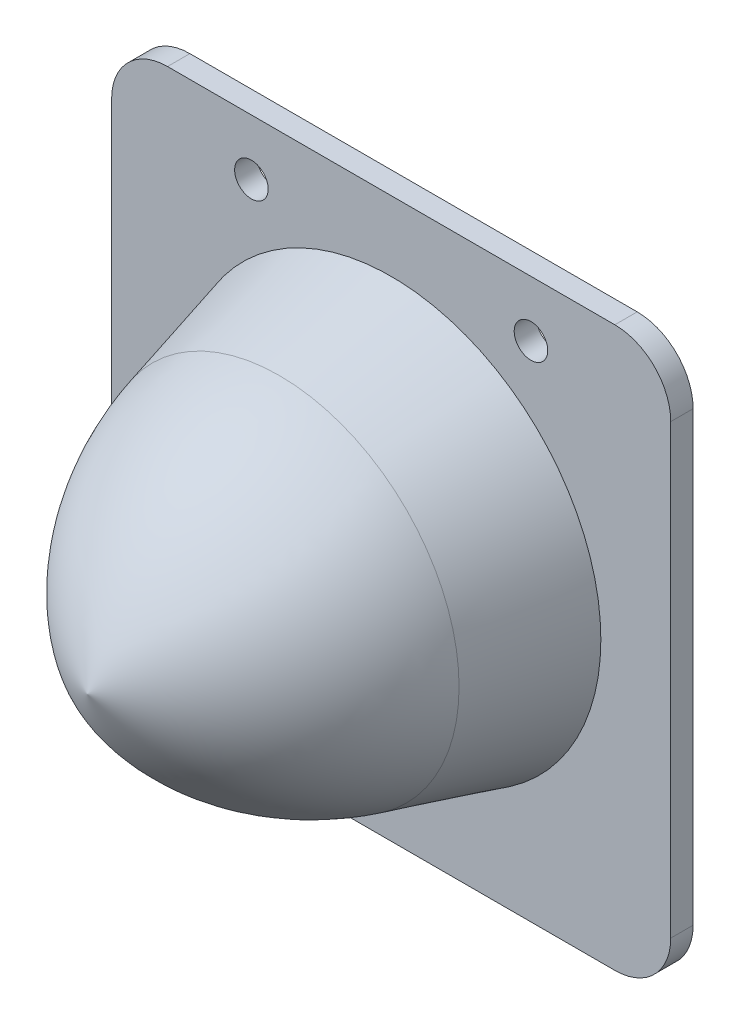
ISO-10303-21;
HEADER;
FILE_DESCRIPTION(('STEP AP214'),'2;1');
FILE_NAME('part.step','',(''),(''),'','','');
FILE_SCHEMA(('AUTOMOTIVE_DESIGN { 1 0 10303 214 1 1 1 1 }'));
ENDSEC;
DATA;
#1=APPLICATION_CONTEXT('core data for automotive mechanical design processes');
#2=APPLICATION_PROTOCOL_DEFINITION('international standard','automotive_design',2000,#1);
#3=PRODUCT_CONTEXT('',#1,'mechanical');
#4=PRODUCT('Part','Part','',(#3));
#5=PRODUCT_RELATED_PRODUCT_CATEGORY('part','',(#4));
#6=PRODUCT_DEFINITION_FORMATION('','',#4);
#7=PRODUCT_DEFINITION_CONTEXT('part definition',#1,'design');
#8=PRODUCT_DEFINITION('design','',#6,#7);
#9=PRODUCT_DEFINITION_SHAPE('','',#8);
#10=(LENGTH_UNIT() NAMED_UNIT(*) SI_UNIT(.MILLI.,.METRE.));
#11=(NAMED_UNIT(*) PLANE_ANGLE_UNIT() SI_UNIT($,.RADIAN.));
#12=(NAMED_UNIT(*) SI_UNIT($,.STERADIAN.) SOLID_ANGLE_UNIT());
#13=UNCERTAINTY_MEASURE_WITH_UNIT(LENGTH_MEASURE(1.E-05),#10,'distance_accuracy_value','');
#14=(GEOMETRIC_REPRESENTATION_CONTEXT(3) GLOBAL_UNCERTAINTY_ASSIGNED_CONTEXT((#13)) GLOBAL_UNIT_ASSIGNED_CONTEXT((#10,
#11,#12)) REPRESENTATION_CONTEXT('',''));
#15=CARTESIAN_POINT('',(0.,0.,0.));
#16=DIRECTION('',(0.,0.,1.));
#17=DIRECTION('',(1.,0.,0.));
#18=AXIS2_PLACEMENT_3D('',#15,#16,#17);
#19=CARTESIAN_POINT('',(50.,50.,4.));
#20=DIRECTION('',(-1.,0.,0.));
#21=DIRECTION('',(0.,0.,1.));
#22=AXIS2_PLACEMENT_3D('',#19,#20,#21);
#23=PLANE('',#22);
#24=DIRECTION('',(0.,1.,0.));
#25=VECTOR('',#24,1.);
#26=CARTESIAN_POINT('',(50.,50.,0.));
#27=LINE('',#26,#25);
#28=CARTESIAN_POINT('',(50.,-40.,0.));
#29=VERTEX_POINT('',#28);
#30=CARTESIAN_POINT('',(50.,40.,0.));
#31=VERTEX_POINT('',#30);
#32=EDGE_CURVE('E139',#29,#31,#27,.T.);
#33=ORIENTED_EDGE('',*,*,#32,.T.);
#34=DIRECTION('',(0.,0.,-1.));
#35=VECTOR('',#34,1.);
#36=CARTESIAN_POINT('',(50.,40.,4.));
#37=LINE('',#36,#35);
#38=CARTESIAN_POINT('',(50.,40.,4.));
#39=VERTEX_POINT('',#38);
#40=EDGE_CURVE('E176',#31,#39,#37,.F.);
#41=ORIENTED_EDGE('',*,*,#40,.T.);
#42=DIRECTION('',(0.,1.,0.));
#43=VECTOR('',#42,1.);
#44=CARTESIAN_POINT('',(50.,50.,4.));
#45=LINE('',#44,#43);
#46=CARTESIAN_POINT('',(50.,-40.,4.));
#47=VERTEX_POINT('',#46);
#48=EDGE_CURVE('E127',#47,#39,#45,.T.);
#49=ORIENTED_EDGE('',*,*,#48,.F.);
#50=DIRECTION('',(0.,0.,-1.));
#51=VECTOR('',#50,1.);
#52=CARTESIAN_POINT('',(50.,-40.,4.));
#53=LINE('',#52,#51);
#54=EDGE_CURVE('E173',#47,#29,#53,.T.);
#55=ORIENTED_EDGE('',*,*,#54,.T.);
#56=EDGE_LOOP('',(#33,#41,#49,#55));
#57=FACE_BOUND('',#56,.T.);
#58=ADVANCED_FACE('F34',(#57),#23,.F.);
#59=CARTESIAN_POINT('',(-50.,50.,4.));
#60=DIRECTION('',(0.,-1.,0.));
#61=DIRECTION('',(0.,0.,-1.));
#62=AXIS2_PLACEMENT_3D('',#59,#60,#61);
#63=PLANE('',#62);
#64=DIRECTION('',(-1.,0.,0.));
#65=VECTOR('',#64,1.);
#66=CARTESIAN_POINT('',(-50.,50.,0.));
#67=LINE('',#66,#65);
#68=CARTESIAN_POINT('',(40.,50.,0.));
#69=VERTEX_POINT('',#68);
#70=CARTESIAN_POINT('',(-40.,50.,0.));
#71=VERTEX_POINT('',#70);
#72=EDGE_CURVE('E142',#69,#71,#67,.T.);
#73=ORIENTED_EDGE('',*,*,#72,.T.);
#74=DIRECTION('',(0.,0.,-1.));
#75=VECTOR('',#74,1.);
#76=CARTESIAN_POINT('',(-40.,50.,4.));
#77=LINE('',#76,#75);
#78=CARTESIAN_POINT('',(-40.,50.,4.));
#79=VERTEX_POINT('',#78);
#80=EDGE_CURVE('E164',#71,#79,#77,.F.);
#81=ORIENTED_EDGE('',*,*,#80,.T.);
#82=DIRECTION('',(-1.,0.,0.));
#83=VECTOR('',#82,1.);
#84=CARTESIAN_POINT('',(-50.,50.,4.));
#85=LINE('',#84,#83);
#86=CARTESIAN_POINT('',(40.,50.,4.));
#87=VERTEX_POINT('',#86);
#88=EDGE_CURVE('E130',#87,#79,#85,.T.);
#89=ORIENTED_EDGE('',*,*,#88,.F.);
#90=DIRECTION('',(0.,0.,-1.));
#91=VECTOR('',#90,1.);
#92=CARTESIAN_POINT('',(40.,50.,4.));
#93=LINE('',#92,#91);
#94=EDGE_CURVE('E161',#87,#69,#93,.T.);
#95=ORIENTED_EDGE('',*,*,#94,.T.);
#96=EDGE_LOOP('',(#73,#81,#89,#95));
#97=FACE_BOUND('',#96,.T.);
#98=ADVANCED_FACE('F202',(#97),#63,.F.);
#99=CARTESIAN_POINT('',(-50.,50.,4.));
#100=DIRECTION('',(1.,0.,0.));
#101=DIRECTION('',(0.,1.,0.));
#102=AXIS2_PLACEMENT_3D('',#99,#100,#101);
#103=PLANE('',#102);
#104=DIRECTION('',(0.,-1.,0.));
#105=VECTOR('',#104,1.);
#106=CARTESIAN_POINT('',(-50.,50.,4.));
#107=LINE('',#106,#105);
#108=CARTESIAN_POINT('',(-50.,40.,4.));
#109=VERTEX_POINT('',#108);
#110=CARTESIAN_POINT('',(-50.,-40.,4.));
#111=VERTEX_POINT('',#110);
#112=EDGE_CURVE('E134',#109,#111,#107,.T.);
#113=ORIENTED_EDGE('',*,*,#112,.F.);
#114=DIRECTION('',(0.,0.,-1.));
#115=VECTOR('',#114,1.);
#116=CARTESIAN_POINT('',(-50.,40.,4.));
#117=LINE('',#116,#115);
#118=CARTESIAN_POINT('',(-50.,40.,0.));
#119=VERTEX_POINT('',#118);
#120=EDGE_CURVE('E150',#109,#119,#117,.T.);
#121=ORIENTED_EDGE('',*,*,#120,.T.);
#122=DIRECTION('',(0.,-1.,0.));
#123=VECTOR('',#122,1.);
#124=CARTESIAN_POINT('',(-50.,50.,0.));
#125=LINE('',#124,#123);
#126=CARTESIAN_POINT('',(-50.,-40.,0.));
#127=VERTEX_POINT('',#126);
#128=EDGE_CURVE('E145',#119,#127,#125,.T.);
#129=ORIENTED_EDGE('',*,*,#128,.T.);
#130=DIRECTION('',(0.,0.,-1.));
#131=VECTOR('',#130,1.);
#132=CARTESIAN_POINT('',(-50.,-40.,4.));
#133=LINE('',#132,#131);
#134=EDGE_CURVE('E138',#127,#111,#133,.F.);
#135=ORIENTED_EDGE('',*,*,#134,.T.);
#136=EDGE_LOOP('',(#113,#121,#129,#135));
#137=FACE_BOUND('',#136,.T.);
#138=ADVANCED_FACE('F208',(#137),#103,.F.);
#139=CARTESIAN_POINT('',(-50.,-50.,4.));
#140=DIRECTION('',(0.,1.,0.));
#141=DIRECTION('',(0.,0.,1.));
#142=AXIS2_PLACEMENT_3D('',#139,#140,#141);
#143=PLANE('',#142);
#144=DIRECTION('',(1.,0.,0.));
#145=VECTOR('',#144,1.);
#146=CARTESIAN_POINT('',(-50.,-50.,0.));
#147=LINE('',#146,#145);
#148=CARTESIAN_POINT('',(-40.,-50.,0.));
#149=VERTEX_POINT('',#148);
#150=CARTESIAN_POINT('',(40.,-50.,0.));
#151=VERTEX_POINT('',#150);
#152=EDGE_CURVE('E131',#149,#151,#147,.T.);
#153=ORIENTED_EDGE('',*,*,#152,.T.);
#154=DIRECTION('',(0.,0.,-1.));
#155=VECTOR('',#154,1.);
#156=CARTESIAN_POINT('',(40.,-50.,4.));
#157=LINE('',#156,#155);
#158=CARTESIAN_POINT('',(40.,-50.,4.));
#159=VERTEX_POINT('',#158);
#160=EDGE_CURVE('E43',#151,#159,#157,.F.);
#161=ORIENTED_EDGE('',*,*,#160,.T.);
#162=DIRECTION('',(1.,0.,0.));
#163=VECTOR('',#162,1.);
#164=CARTESIAN_POINT('',(-50.,-50.,4.));
#165=LINE('',#164,#163);
#166=CARTESIAN_POINT('',(-40.,-50.,4.));
#167=VERTEX_POINT('',#166);
#168=EDGE_CURVE('E136',#167,#159,#165,.T.);
#169=ORIENTED_EDGE('',*,*,#168,.F.);
#170=DIRECTION('',(0.,0.,-1.));
#171=VECTOR('',#170,1.);
#172=CARTESIAN_POINT('',(-40.,-50.,4.));
#173=LINE('',#172,#171);
#174=EDGE_CURVE('E178',#167,#149,#173,.T.);
#175=ORIENTED_EDGE('',*,*,#174,.T.);
#176=EDGE_LOOP('',(#153,#161,#169,#175));
#177=FACE_BOUND('',#176,.T.);
#178=ADVANCED_FACE('F246',(#177),#143,.F.);
#179=CARTESIAN_POINT('',(0.,0.,4.));
#180=DIRECTION('',(0.,0.,1.));
#181=DIRECTION('',(1.,0.,0.));
#182=AXIS2_PLACEMENT_3D('',#179,#180,#181);
#183=PLANE('',#182);
#184=CARTESIAN_POINT('',(0.,0.,4.));
#185=DIRECTION('',(0.,0.,1.));
#186=DIRECTION('',(1.,0.,0.));
#187=AXIS2_PLACEMENT_3D('',#184,#185,#186);
#188=CIRCLE('',#187,37.5);
#189=CARTESIAN_POINT('',(37.5,0.,4.));
#190=VERTEX_POINT('',#189);
#191=EDGE_CURVE('E11',#190,#190,#188,.T.);
#192=ORIENTED_EDGE('',*,*,#191,.F.);
#193=EDGE_LOOP('',(#192));
#194=FACE_BOUND('',#193,.T.);
#195=CARTESIAN_POINT('',(25.,40.,4.));
#196=DIRECTION('',(0.,0.,1.));
#197=DIRECTION('',(1.,0.,0.));
#198=AXIS2_PLACEMENT_3D('',#195,#196,#197);
#199=CIRCLE('',#198,3.);
#200=CARTESIAN_POINT('',(28.,40.,4.));
#201=VERTEX_POINT('',#200);
#202=EDGE_CURVE('E117',#201,#201,#199,.T.);
#203=ORIENTED_EDGE('',*,*,#202,.F.);
#204=EDGE_LOOP('',(#203));
#205=FACE_BOUND('',#204,.T.);
#206=CARTESIAN_POINT('',(-25.,40.,4.));
#207=DIRECTION('',(0.,0.,1.));
#208=DIRECTION('',(1.,0.,0.));
#209=AXIS2_PLACEMENT_3D('',#206,#207,#208);
#210=CIRCLE('',#209,3.);
#211=CARTESIAN_POINT('',(-22.,40.,4.));
#212=VERTEX_POINT('',#211);
#213=EDGE_CURVE('E113',#212,#212,#210,.T.);
#214=ORIENTED_EDGE('',*,*,#213,.F.);
#215=EDGE_LOOP('',(#214));
#216=FACE_BOUND('',#215,.T.);
#217=ORIENTED_EDGE('',*,*,#88,.T.);
#218=CARTESIAN_POINT('',(-40.,40.,4.));
#219=DIRECTION('',(0.,0.,1.));
#220=DIRECTION('',(1.,0.,0.));
#221=AXIS2_PLACEMENT_3D('',#218,#219,#220);
#222=CIRCLE('',#221,10.);
#223=EDGE_CURVE('E171',#79,#109,#222,.T.);
#224=ORIENTED_EDGE('',*,*,#223,.T.);
#225=ORIENTED_EDGE('',*,*,#112,.T.);
#226=CARTESIAN_POINT('',(-40.,-40.,4.));
#227=DIRECTION('',(0.,0.,1.));
#228=DIRECTION('',(1.,0.,0.));
#229=AXIS2_PLACEMENT_3D('',#226,#227,#228);
#230=CIRCLE('',#229,10.);
#231=EDGE_CURVE('E57',#111,#167,#230,.T.);
#232=ORIENTED_EDGE('',*,*,#231,.T.);
#233=ORIENTED_EDGE('',*,*,#168,.T.);
#234=CARTESIAN_POINT('',(40.,-40.,4.));
#235=DIRECTION('',(0.,0.,1.));
#236=DIRECTION('',(1.,0.,0.));
#237=AXIS2_PLACEMENT_3D('',#234,#235,#236);
#238=CIRCLE('',#237,10.);
#239=EDGE_CURVE('E167',#159,#47,#238,.T.);
#240=ORIENTED_EDGE('',*,*,#239,.T.);
#241=ORIENTED_EDGE('',*,*,#48,.T.);
#242=CARTESIAN_POINT('',(40.,40.,4.));
#243=DIRECTION('',(0.,0.,1.));
#244=DIRECTION('',(1.,0.,0.));
#245=AXIS2_PLACEMENT_3D('',#242,#243,#244);
#246=CIRCLE('',#245,10.);
#247=EDGE_CURVE('E169',#39,#87,#246,.T.);
#248=ORIENTED_EDGE('',*,*,#247,.T.);
#249=EDGE_LOOP('',(#217,#224,#225,#232,#233,#240,#241,#248));
#250=FACE_BOUND('',#249,.T.);
#251=ADVANCED_FACE('F230',(#194,#205,#216,#250),#183,.T.);
#252=CARTESIAN_POINT('',(0.,0.,0.));
#253=DIRECTION('',(0.,0.,1.));
#254=DIRECTION('',(1.,0.,0.));
#255=AXIS2_PLACEMENT_3D('',#252,#253,#254);
#256=PLANE('',#255);
#257=CARTESIAN_POINT('',(0.,0.,0.));
#258=DIRECTION('',(0.,0.,-1.));
#259=DIRECTION('',(-1.,0.,0.));
#260=AXIS2_PLACEMENT_3D('',#257,#258,#259);
#261=CIRCLE('',#260,14.7814284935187);
#262=CARTESIAN_POINT('',(-14.7814284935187,0.,0.));
#263=VERTEX_POINT('',#262);
#264=EDGE_CURVE('E120',#263,#263,#261,.T.);
#265=ORIENTED_EDGE('',*,*,#264,.F.);
#266=EDGE_LOOP('',(#265));
#267=FACE_BOUND('',#266,.T.);
#268=CARTESIAN_POINT('',(25.,40.,0.));
#269=DIRECTION('',(0.,0.,1.));
#270=DIRECTION('',(1.,0.,0.));
#271=AXIS2_PLACEMENT_3D('',#268,#269,#270);
#272=CIRCLE('',#271,3.);
#273=CARTESIAN_POINT('',(28.,40.,0.));
#274=VERTEX_POINT('',#273);
#275=EDGE_CURVE('E38',#274,#274,#272,.T.);
#276=ORIENTED_EDGE('',*,*,#275,.T.);
#277=EDGE_LOOP('',(#276));
#278=FACE_BOUND('',#277,.T.);
#279=CARTESIAN_POINT('',(-25.,40.,0.));
#280=DIRECTION('',(0.,0.,1.));
#281=DIRECTION('',(1.,0.,0.));
#282=AXIS2_PLACEMENT_3D('',#279,#280,#281);
#283=CIRCLE('',#282,3.);
#284=CARTESIAN_POINT('',(-22.,40.,0.));
#285=VERTEX_POINT('',#284);
#286=EDGE_CURVE('E125',#285,#285,#283,.T.);
#287=ORIENTED_EDGE('',*,*,#286,.T.);
#288=EDGE_LOOP('',(#287));
#289=FACE_BOUND('',#288,.T.);
#290=ORIENTED_EDGE('',*,*,#128,.F.);
#291=CARTESIAN_POINT('',(-40.,40.,0.));
#292=DIRECTION('',(0.,0.,1.));
#293=DIRECTION('',(1.,0.,0.));
#294=AXIS2_PLACEMENT_3D('',#291,#292,#293);
#295=CIRCLE('',#294,10.);
#296=EDGE_CURVE('E159',#119,#71,#295,.F.);
#297=ORIENTED_EDGE('',*,*,#296,.T.);
#298=ORIENTED_EDGE('',*,*,#72,.F.);
#299=CARTESIAN_POINT('',(40.,40.,0.));
#300=DIRECTION('',(0.,0.,1.));
#301=DIRECTION('',(1.,0.,0.));
#302=AXIS2_PLACEMENT_3D('',#299,#300,#301);
#303=CIRCLE('',#302,10.);
#304=EDGE_CURVE('E157',#69,#31,#303,.F.);
#305=ORIENTED_EDGE('',*,*,#304,.T.);
#306=ORIENTED_EDGE('',*,*,#32,.F.);
#307=CARTESIAN_POINT('',(40.,-40.,0.));
#308=DIRECTION('',(0.,0.,1.));
#309=DIRECTION('',(1.,0.,0.));
#310=AXIS2_PLACEMENT_3D('',#307,#308,#309);
#311=CIRCLE('',#310,10.);
#312=EDGE_CURVE('E155',#29,#151,#311,.F.);
#313=ORIENTED_EDGE('',*,*,#312,.T.);
#314=ORIENTED_EDGE('',*,*,#152,.F.);
#315=CARTESIAN_POINT('',(-40.,-40.,0.));
#316=DIRECTION('',(0.,0.,1.));
#317=DIRECTION('',(1.,0.,0.));
#318=AXIS2_PLACEMENT_3D('',#315,#316,#317);
#319=CIRCLE('',#318,10.);
#320=EDGE_CURVE('E153',#149,#127,#319,.F.);
#321=ORIENTED_EDGE('',*,*,#320,.T.);
#322=EDGE_LOOP('',(#290,#297,#298,#305,#306,#313,#314,#321));
#323=FACE_BOUND('',#322,.T.);
#324=ADVANCED_FACE('F187',(#267,#278,#289,#323),#256,.F.);
#325=CARTESIAN_POINT('',(-40.,40.,4.));
#326=DIRECTION('',(0.,0.,-1.));
#327=DIRECTION('',(-1.,0.,0.));
#328=AXIS2_PLACEMENT_3D('',#325,#326,#327);
#329=CYLINDRICAL_SURFACE('',#328,10.);
#330=ORIENTED_EDGE('',*,*,#223,.F.);
#331=ORIENTED_EDGE('',*,*,#80,.F.);
#332=ORIENTED_EDGE('',*,*,#296,.F.);
#333=ORIENTED_EDGE('',*,*,#120,.F.);
#334=EDGE_LOOP('',(#330,#331,#332,#333));
#335=FACE_BOUND('',#334,.T.);
#336=ADVANCED_FACE('F213',(#335),#329,.T.);
#337=CARTESIAN_POINT('',(40.,40.,4.));
#338=DIRECTION('',(0.,0.,-1.));
#339=DIRECTION('',(-1.,0.,0.));
#340=AXIS2_PLACEMENT_3D('',#337,#338,#339);
#341=CYLINDRICAL_SURFACE('',#340,10.);
#342=ORIENTED_EDGE('',*,*,#247,.F.);
#343=ORIENTED_EDGE('',*,*,#40,.F.);
#344=ORIENTED_EDGE('',*,*,#304,.F.);
#345=ORIENTED_EDGE('',*,*,#94,.F.);
#346=EDGE_LOOP('',(#342,#343,#344,#345));
#347=FACE_BOUND('',#346,.T.);
#348=ADVANCED_FACE('F216',(#347),#341,.T.);
#349=CARTESIAN_POINT('',(40.,-40.,4.));
#350=DIRECTION('',(0.,0.,-1.));
#351=DIRECTION('',(-1.,0.,0.));
#352=AXIS2_PLACEMENT_3D('',#349,#350,#351);
#353=CYLINDRICAL_SURFACE('',#352,10.);
#354=ORIENTED_EDGE('',*,*,#239,.F.);
#355=ORIENTED_EDGE('',*,*,#160,.F.);
#356=ORIENTED_EDGE('',*,*,#312,.F.);
#357=ORIENTED_EDGE('',*,*,#54,.F.);
#358=EDGE_LOOP('',(#354,#355,#356,#357));
#359=FACE_BOUND('',#358,.T.);
#360=ADVANCED_FACE('F219',(#359),#353,.T.);
#361=CARTESIAN_POINT('',(-40.,-40.,4.));
#362=DIRECTION('',(0.,0.,-1.));
#363=DIRECTION('',(-1.,0.,0.));
#364=AXIS2_PLACEMENT_3D('',#361,#362,#363);
#365=CYLINDRICAL_SURFACE('',#364,10.);
#366=ORIENTED_EDGE('',*,*,#231,.F.);
#367=ORIENTED_EDGE('',*,*,#134,.F.);
#368=ORIENTED_EDGE('',*,*,#320,.F.);
#369=ORIENTED_EDGE('',*,*,#174,.F.);
#370=EDGE_LOOP('',(#366,#367,#368,#369));
#371=FACE_BOUND('',#370,.T.);
#372=ADVANCED_FACE('F36',(#371),#365,.T.);
#373=CARTESIAN_POINT('',(-25.,40.,-16.));
#374=DIRECTION('',(0.,0.,1.));
#375=DIRECTION('',(1.,0.,0.));
#376=AXIS2_PLACEMENT_3D('',#373,#374,#375);
#377=CYLINDRICAL_SURFACE('',#376,3.);
#378=ORIENTED_EDGE('',*,*,#213,.T.);
#379=EDGE_LOOP('',(#378));
#380=FACE_BOUND('',#379,.T.);
#381=ORIENTED_EDGE('',*,*,#286,.F.);
#382=EDGE_LOOP('',(#381));
#383=FACE_BOUND('',#382,.T.);
#384=ADVANCED_FACE('F191',(#380,#383),#377,.F.);
#385=CARTESIAN_POINT('',(25.,40.,-16.));
#386=DIRECTION('',(0.,0.,1.));
#387=DIRECTION('',(1.,0.,0.));
#388=AXIS2_PLACEMENT_3D('',#385,#386,#387);
#389=CYLINDRICAL_SURFACE('',#388,3.);
#390=ORIENTED_EDGE('',*,*,#202,.T.);
#391=EDGE_LOOP('',(#390));
#392=FACE_BOUND('',#391,.T.);
#393=ORIENTED_EDGE('',*,*,#275,.F.);
#394=EDGE_LOOP('',(#393));
#395=FACE_BOUND('',#394,.T.);
#396=ADVANCED_FACE('F189',(#392,#395),#389,.F.);
#397=CARTESIAN_POINT('',(0.,0.,4.));
#398=DIRECTION('',(0.,0.,-1.));
#399=DIRECTION('',(1.,0.,0.));
#400=AXIS2_PLACEMENT_3D('',#397,#398,#399);
#401=CONICAL_SURFACE('',#400,37.5,0.261799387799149);
#402=CARTESIAN_POINT('',(0.,0.,24.));
#403=DIRECTION('',(0.,0.,1.));
#404=DIRECTION('',(1.,0.,0.));
#405=AXIS2_PLACEMENT_3D('',#402,#403,#404);
#406=CIRCLE('',#405,32.1410161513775);
#407=CARTESIAN_POINT('',(32.1410161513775,0.,24.));
#408=VERTEX_POINT('',#407);
#409=EDGE_CURVE('E111',#408,#408,#406,.T.);
#410=ORIENTED_EDGE('',*,*,#409,.F.);
#411=EDGE_LOOP('',(#410));
#412=FACE_BOUND('',#411,.T.);
#413=ORIENTED_EDGE('',*,*,#191,.T.);
#414=EDGE_LOOP('',(#413));
#415=FACE_BOUND('',#414,.T.);
#416=ADVANCED_FACE('F107',(#412,#415),#401,.T.);
#417=CARTESIAN_POINT('',(16.1552751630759,0.,11.059047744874));
#418=DIRECTION('',(0.,-1.,0.));
#419=DIRECTION('',(-1.,0.,0.));
#420=AXIS2_PLACEMENT_3D('',#417,#418,#419);
#421=CIRCLE('',#420,50.);
#422=TRIMMED_CURVE('',#421,(PARAMETER_VALUE(-1.24178715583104)),
(PARAMETER_VALUE(1.24178715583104)),.T.,.PARAMETER.);
#423=CARTESIAN_POINT('',(0.,0.,11.059047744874));
#424=DIRECTION('',(0.,0.,-1.));
#425=AXIS1_PLACEMENT('',#423,#424);
#426=SURFACE_OF_REVOLUTION('',#422,#425);
#427=CARTESIAN_POINT('',(0.,0.,58.3771952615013));
#428=VERTEX_POINT('',#427);
#429=VERTEX_LOOP('',#428);
#430=FACE_BOUND('',#429,.T.);
#431=ORIENTED_EDGE('',*,*,#409,.T.);
#432=EDGE_LOOP('',(#431));
#433=FACE_BOUND('',#432,.T.);
#434=ADVANCED_FACE('F103',(#430,#433),#426,.T.);
#435=CARTESIAN_POINT('',(0.,0.,10.));
#436=DIRECTION('',(0.,0.,-1.));
#437=DIRECTION('',(-1.,0.,0.));
#438=AXIS2_PLACEMENT_3D('',#435,#436,#437);
#439=CYLINDRICAL_SURFACE('',#438,14.7814284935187);
#440=CARTESIAN_POINT('',(0.,0.,10.));
#441=DIRECTION('',(0.,0.,-1.));
#442=DIRECTION('',(-1.,0.,0.));
#443=AXIS2_PLACEMENT_3D('',#440,#441,#442);
#444=CIRCLE('',#443,14.7814284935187);
#445=CARTESIAN_POINT('',(-14.7814284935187,0.,10.));
#446=VERTEX_POINT('',#445);
#447=EDGE_CURVE('E114',#446,#446,#444,.T.);
#448=ORIENTED_EDGE('',*,*,#447,.F.);
#449=EDGE_LOOP('',(#448));
#450=FACE_BOUND('',#449,.T.);
#451=ORIENTED_EDGE('',*,*,#264,.T.);
#452=EDGE_LOOP('',(#451));
#453=FACE_BOUND('',#452,.T.);
#454=ADVANCED_FACE('F106',(#450,#453),#439,.F.);
#455=CARTESIAN_POINT('',(0.,0.,10.));
#456=DIRECTION('',(0.,0.,-1.));
#457=DIRECTION('',(-1.,0.,0.));
#458=AXIS2_PLACEMENT_3D('',#455,#456,#457);
#459=PLANE('',#458);
#460=ORIENTED_EDGE('',*,*,#447,.T.);
#461=EDGE_LOOP('',(#460));
#462=FACE_BOUND('',#461,.T.);
#463=ADVANCED_FACE('F304',(#462),#459,.T.);
#464=CLOSED_SHELL('',(#58,#98,#138,#178,#251,#324,#336,#348,#360,#372,#384,#396,#416,#434,#454,#463));
#465=MANIFOLD_SOLID_BREP('B2',#464);
#466=ADVANCED_BREP_SHAPE_REPRESENTATION('',(#18,#465),#14);
#467=SHAPE_DEFINITION_REPRESENTATION(#9,#466);
ENDSEC;
END-ISO-10303-21;
